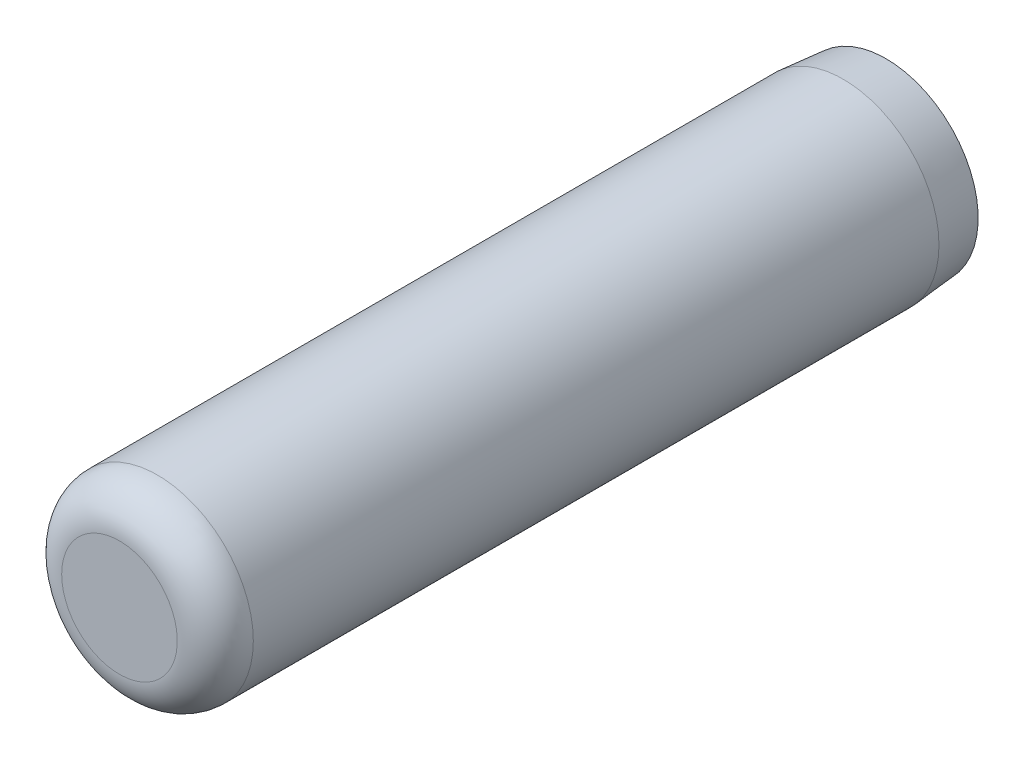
from build123d import *


with BuildPart() as part:
    # Logo3_bib1 → Revolve1 (revolve)
    with BuildSketch(Plane(origin=(0, 0, 0), x_dir=(-1, 0, 0), z_dir=(0, -1, 0))):
        with BuildLine():
            Line((0, 15.875), (0, -15.875))
            Line((0, -15.875), (2.39395, -15.875))
            ThreePointArc((2.39395, -15.875), (3.507501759, -15.413751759), (3.96875, -14.3002))
            Line((3.96875, -14.3002), (3.96875, 14.097))
            Line((3.96875, 14.097), (3.813195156, 15.875))
            Line((3.813195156, 15.875), (0, 15.875))
        make_face()
    revolve(axis=Axis((0, 0, -47.537203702), (0, 0, 1)))


solid = part.part
